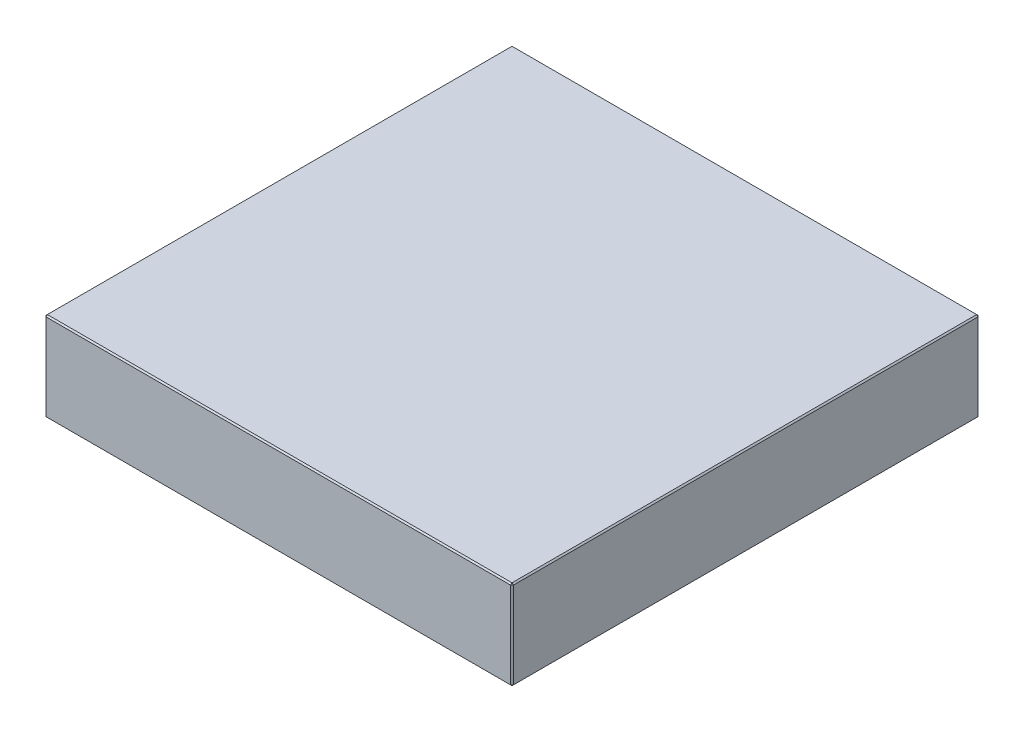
ISO-10303-21;
HEADER;
FILE_DESCRIPTION(('STEP AP214'),'2;1');
FILE_NAME('part.step','',(''),(''),'','','');
FILE_SCHEMA(('AUTOMOTIVE_DESIGN { 1 0 10303 214 1 1 1 1 }'));
ENDSEC;
DATA;
#1=APPLICATION_CONTEXT('core data for automotive mechanical design processes');
#2=APPLICATION_PROTOCOL_DEFINITION('international standard','automotive_design',2000,#1);
#3=PRODUCT_CONTEXT('',#1,'mechanical');
#4=PRODUCT('Part','Part','',(#3));
#5=PRODUCT_RELATED_PRODUCT_CATEGORY('part','',(#4));
#6=PRODUCT_DEFINITION_FORMATION('','',#4);
#7=PRODUCT_DEFINITION_CONTEXT('part definition',#1,'design');
#8=PRODUCT_DEFINITION('design','',#6,#7);
#9=PRODUCT_DEFINITION_SHAPE('','',#8);
#10=(LENGTH_UNIT() NAMED_UNIT(*) SI_UNIT(.MILLI.,.METRE.));
#11=(NAMED_UNIT(*) PLANE_ANGLE_UNIT() SI_UNIT($,.RADIAN.));
#12=(NAMED_UNIT(*) SI_UNIT($,.STERADIAN.) SOLID_ANGLE_UNIT());
#13=UNCERTAINTY_MEASURE_WITH_UNIT(LENGTH_MEASURE(1.E-05),#10,'distance_accuracy_value','');
#14=(GEOMETRIC_REPRESENTATION_CONTEXT(3) GLOBAL_UNCERTAINTY_ASSIGNED_CONTEXT((#13)) GLOBAL_UNIT_ASSIGNED_CONTEXT((#10,
#11,#12)) REPRESENTATION_CONTEXT('',''));
#15=CARTESIAN_POINT('',(0.,0.,0.));
#16=DIRECTION('',(0.,0.,1.));
#17=DIRECTION('',(1.,0.,0.));
#18=AXIS2_PLACEMENT_3D('',#15,#16,#17);
#19=CARTESIAN_POINT('',(-173.,66.,173.));
#20=DIRECTION('',(1.,0.,0.));
#21=DIRECTION('',(0.,0.,-1.));
#22=AXIS2_PLACEMENT_3D('',#19,#20,#21);
#23=PLANE('',#22);
#24=DIRECTION('',(0.,-1.,0.));
#25=VECTOR('',#24,1.);
#26=CARTESIAN_POINT('',(-173.,66.,-172.));
#27=LINE('',#26,#25);
#28=CARTESIAN_POINT('',(-173.,65.,-172.));
#29=VERTEX_POINT('',#28);
#30=CARTESIAN_POINT('',(-173.,1.00000000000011,-172.));
#31=VERTEX_POINT('',#30);
#32=EDGE_CURVE('E114',#29,#31,#27,.T.);
#33=ORIENTED_EDGE('',*,*,#32,.T.);
#34=DIRECTION('',(0.,0.,1.));
#35=VECTOR('',#34,1.);
#36=CARTESIAN_POINT('',(-173.,1.00000000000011,173.));
#37=LINE('',#36,#35);
#38=CARTESIAN_POINT('',(-173.,1.00000000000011,172.));
#39=VERTEX_POINT('',#38);
#40=EDGE_CURVE('E110',#31,#39,#37,.T.);
#41=ORIENTED_EDGE('',*,*,#40,.T.);
#42=DIRECTION('',(0.,1.,0.));
#43=VECTOR('',#42,1.);
#44=CARTESIAN_POINT('',(-173.,66.,172.));
#45=LINE('',#44,#43);
#46=CARTESIAN_POINT('',(-173.,65.,172.));
#47=VERTEX_POINT('',#46);
#48=EDGE_CURVE('E103',#39,#47,#45,.T.);
#49=ORIENTED_EDGE('',*,*,#48,.T.);
#50=DIRECTION('',(0.,0.,-1.));
#51=VECTOR('',#50,1.);
#52=CARTESIAN_POINT('',(-173.,65.,-173.));
#53=LINE('',#52,#51);
#54=EDGE_CURVE('E107',#47,#29,#53,.T.);
#55=ORIENTED_EDGE('',*,*,#54,.T.);
#56=EDGE_LOOP('',(#33,#41,#49,#55));
#57=FACE_BOUND('',#56,.T.);
#58=ADVANCED_FACE('F15',(#57),#23,.F.);
#59=CARTESIAN_POINT('',(173.,66.,173.));
#60=DIRECTION('',(0.,0.,-1.));
#61=DIRECTION('',(-1.,0.,0.));
#62=AXIS2_PLACEMENT_3D('',#59,#60,#61);
#63=PLANE('',#62);
#64=DIRECTION('',(-1.,0.,0.));
#65=VECTOR('',#64,1.);
#66=CARTESIAN_POINT('',(-173.,65.,173.));
#67=LINE('',#66,#65);
#68=CARTESIAN_POINT('',(172.,65.,173.));
#69=VERTEX_POINT('',#68);
#70=CARTESIAN_POINT('',(-172.,65.,173.));
#71=VERTEX_POINT('',#70);
#72=EDGE_CURVE('E164',#69,#71,#67,.T.);
#73=ORIENTED_EDGE('',*,*,#72,.T.);
#74=DIRECTION('',(0.,-1.,0.));
#75=VECTOR('',#74,1.);
#76=CARTESIAN_POINT('',(-172.,66.,173.));
#77=LINE('',#76,#75);
#78=CARTESIAN_POINT('',(-172.,1.00000000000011,173.));
#79=VERTEX_POINT('',#78);
#80=EDGE_CURVE('E122',#71,#79,#77,.T.);
#81=ORIENTED_EDGE('',*,*,#80,.T.);
#82=DIRECTION('',(1.,0.,0.));
#83=VECTOR('',#82,1.);
#84=CARTESIAN_POINT('',(173.,1.00000000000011,173.));
#85=LINE('',#84,#83);
#86=CARTESIAN_POINT('',(172.,1.00000000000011,173.));
#87=VERTEX_POINT('',#86);
#88=EDGE_CURVE('E168',#79,#87,#85,.T.);
#89=ORIENTED_EDGE('',*,*,#88,.T.);
#90=DIRECTION('',(0.,1.,0.));
#91=VECTOR('',#90,1.);
#92=CARTESIAN_POINT('',(172.,66.,173.));
#93=LINE('',#92,#91);
#94=EDGE_CURVE('E166',#87,#69,#93,.T.);
#95=ORIENTED_EDGE('',*,*,#94,.T.);
#96=EDGE_LOOP('',(#73,#81,#89,#95));
#97=FACE_BOUND('',#96,.T.);
#98=ADVANCED_FACE('F275',(#97),#63,.F.);
#99=CARTESIAN_POINT('',(173.,66.,173.));
#100=DIRECTION('',(-1.,0.,0.));
#101=DIRECTION('',(0.,0.,1.));
#102=AXIS2_PLACEMENT_3D('',#99,#100,#101);
#103=PLANE('',#102);
#104=DIRECTION('',(0.,0.,-1.));
#105=VECTOR('',#104,1.);
#106=CARTESIAN_POINT('',(173.,1.00000000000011,173.));
#107=LINE('',#106,#105);
#108=CARTESIAN_POINT('',(173.,1.00000000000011,172.));
#109=VERTEX_POINT('',#108);
#110=CARTESIAN_POINT('',(173.,1.00000000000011,-172.));
#111=VERTEX_POINT('',#110);
#112=EDGE_CURVE('E159',#109,#111,#107,.T.);
#113=ORIENTED_EDGE('',*,*,#112,.T.);
#114=DIRECTION('',(0.,1.,0.));
#115=VECTOR('',#114,1.);
#116=CARTESIAN_POINT('',(173.,66.,-172.));
#117=LINE('',#116,#115);
#118=CARTESIAN_POINT('',(173.,65.,-172.));
#119=VERTEX_POINT('',#118);
#120=EDGE_CURVE('E161',#111,#119,#117,.T.);
#121=ORIENTED_EDGE('',*,*,#120,.T.);
#122=DIRECTION('',(0.,0.,1.));
#123=VECTOR('',#122,1.);
#124=CARTESIAN_POINT('',(173.,65.,173.));
#125=LINE('',#124,#123);
#126=CARTESIAN_POINT('',(173.,65.,172.));
#127=VERTEX_POINT('',#126);
#128=EDGE_CURVE('E155',#119,#127,#125,.T.);
#129=ORIENTED_EDGE('',*,*,#128,.T.);
#130=DIRECTION('',(0.,-1.,0.));
#131=VECTOR('',#130,1.);
#132=CARTESIAN_POINT('',(173.,66.,172.));
#133=LINE('',#132,#131);
#134=EDGE_CURVE('E157',#127,#109,#133,.T.);
#135=ORIENTED_EDGE('',*,*,#134,.T.);
#136=EDGE_LOOP('',(#113,#121,#129,#135));
#137=FACE_BOUND('',#136,.T.);
#138=ADVANCED_FACE('F254',(#137),#103,.F.);
#139=CARTESIAN_POINT('',(173.,66.,-173.));
#140=DIRECTION('',(0.,0.,1.));
#141=DIRECTION('',(1.,0.,0.));
#142=AXIS2_PLACEMENT_3D('',#139,#140,#141);
#143=PLANE('',#142);
#144=DIRECTION('',(0.,-1.,0.));
#145=VECTOR('',#144,1.);
#146=CARTESIAN_POINT('',(172.,66.,-173.));
#147=LINE('',#146,#145);
#148=CARTESIAN_POINT('',(172.,65.,-173.));
#149=VERTEX_POINT('',#148);
#150=CARTESIAN_POINT('',(172.,1.00000000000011,-173.));
#151=VERTEX_POINT('',#150);
#152=EDGE_CURVE('E148',#149,#151,#147,.T.);
#153=ORIENTED_EDGE('',*,*,#152,.T.);
#154=DIRECTION('',(-1.,0.,0.));
#155=VECTOR('',#154,1.);
#156=CARTESIAN_POINT('',(173.,1.00000000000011,-173.));
#157=LINE('',#156,#155);
#158=CARTESIAN_POINT('',(-172.,1.00000000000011,-173.));
#159=VERTEX_POINT('',#158);
#160=EDGE_CURVE('E153',#151,#159,#157,.T.);
#161=ORIENTED_EDGE('',*,*,#160,.T.);
#162=DIRECTION('',(0.,1.,0.));
#163=VECTOR('',#162,1.);
#164=CARTESIAN_POINT('',(-172.,66.,-173.));
#165=LINE('',#164,#163);
#166=CARTESIAN_POINT('',(-172.,65.,-173.));
#167=VERTEX_POINT('',#166);
#168=EDGE_CURVE('E150',#159,#167,#165,.T.);
#169=ORIENTED_EDGE('',*,*,#168,.T.);
#170=DIRECTION('',(1.,0.,0.));
#171=VECTOR('',#170,1.);
#172=CARTESIAN_POINT('',(173.,65.,-173.));
#173=LINE('',#172,#171);
#174=EDGE_CURVE('E146',#167,#149,#173,.T.);
#175=ORIENTED_EDGE('',*,*,#174,.T.);
#176=EDGE_LOOP('',(#153,#161,#169,#175));
#177=FACE_BOUND('',#176,.T.);
#178=ADVANCED_FACE('F284',(#177),#143,.F.);
#179=CARTESIAN_POINT('',(0.,66.,0.));
#180=DIRECTION('',(0.,1.,0.));
#181=DIRECTION('',(0.,0.,1.));
#182=AXIS2_PLACEMENT_3D('',#179,#180,#181);
#183=PLANE('',#182);
#184=DIRECTION('',(0.,0.,-1.));
#185=VECTOR('',#184,1.);
#186=CARTESIAN_POINT('',(172.,66.,-173.));
#187=LINE('',#186,#185);
#188=CARTESIAN_POINT('',(172.,66.,172.));
#189=VERTEX_POINT('',#188);
#190=CARTESIAN_POINT('',(172.,66.,-172.));
#191=VERTEX_POINT('',#190);
#192=EDGE_CURVE('E24',#189,#191,#187,.T.);
#193=ORIENTED_EDGE('',*,*,#192,.T.);
#194=DIRECTION('',(-1.,0.,0.));
#195=VECTOR('',#194,1.);
#196=CARTESIAN_POINT('',(-173.,66.,-172.));
#197=LINE('',#196,#195);
#198=CARTESIAN_POINT('',(-172.,66.,-172.));
#199=VERTEX_POINT('',#198);
#200=EDGE_CURVE('E9',#191,#199,#197,.T.);
#201=ORIENTED_EDGE('',*,*,#200,.T.);
#202=DIRECTION('',(0.,0.,1.));
#203=VECTOR('',#202,1.);
#204=CARTESIAN_POINT('',(-172.,66.,173.));
#205=LINE('',#204,#203);
#206=CARTESIAN_POINT('',(-172.,66.,172.));
#207=VERTEX_POINT('',#206);
#208=EDGE_CURVE('E180',#199,#207,#205,.T.);
#209=ORIENTED_EDGE('',*,*,#208,.T.);
#210=DIRECTION('',(1.,0.,0.));
#211=VECTOR('',#210,1.);
#212=CARTESIAN_POINT('',(173.,66.,172.));
#213=LINE('',#212,#211);
#214=EDGE_CURVE('E35',#207,#189,#213,.T.);
#215=ORIENTED_EDGE('',*,*,#214,.T.);
#216=EDGE_LOOP('',(#193,#201,#209,#215));
#217=FACE_BOUND('',#216,.T.);
#218=ADVANCED_FACE('F350',(#217),#183,.T.);
#219=CARTESIAN_POINT('',(0.,0.,0.));
#220=DIRECTION('',(0.,1.,0.));
#221=DIRECTION('',(0.,0.,1.));
#222=AXIS2_PLACEMENT_3D('',#219,#220,#221);
#223=PLANE('',#222);
#224=DIRECTION('',(0.,0.,1.));
#225=VECTOR('',#224,1.);
#226=CARTESIAN_POINT('',(172.,0.,0.));
#227=LINE('',#226,#225);
#228=CARTESIAN_POINT('',(172.,0.,-172.));
#229=VERTEX_POINT('',#228);
#230=CARTESIAN_POINT('',(172.,0.,172.));
#231=VERTEX_POINT('',#230);
#232=EDGE_CURVE('E171',#229,#231,#227,.T.);
#233=ORIENTED_EDGE('',*,*,#232,.T.);
#234=DIRECTION('',(-1.,0.,0.));
#235=VECTOR('',#234,1.);
#236=CARTESIAN_POINT('',(0.,0.,172.));
#237=LINE('',#236,#235);
#238=CARTESIAN_POINT('',(-172.,0.,172.));
#239=VERTEX_POINT('',#238);
#240=EDGE_CURVE('E177',#231,#239,#237,.T.);
#241=ORIENTED_EDGE('',*,*,#240,.T.);
#242=DIRECTION('',(0.,0.,-1.));
#243=VECTOR('',#242,1.);
#244=CARTESIAN_POINT('',(-172.,0.,0.));
#245=LINE('',#244,#243);
#246=CARTESIAN_POINT('',(-172.,0.,-172.));
#247=VERTEX_POINT('',#246);
#248=EDGE_CURVE('E175',#239,#247,#245,.T.);
#249=ORIENTED_EDGE('',*,*,#248,.T.);
#250=DIRECTION('',(1.,0.,0.));
#251=VECTOR('',#250,1.);
#252=CARTESIAN_POINT('',(0.,0.,-172.));
#253=LINE('',#252,#251);
#254=EDGE_CURVE('E173',#247,#229,#253,.T.);
#255=ORIENTED_EDGE('',*,*,#254,.T.);
#256=EDGE_LOOP('',(#233,#241,#249,#255));
#257=FACE_BOUND('',#256,.T.);
#258=ADVANCED_FACE('F246',(#257),#223,.F.);
#259=CARTESIAN_POINT('',(173.,66.,172.));
#260=DIRECTION('',(-0.707106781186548,0.,-0.707106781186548));
#261=DIRECTION('',(0.,-1.,0.));
#262=AXIS2_PLACEMENT_3D('',#259,#260,#261);
#263=PLANE('',#262);
#264=DIRECTION('',(-0.707106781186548,0.,0.707106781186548));
#265=VECTOR('',#264,1.);
#266=CARTESIAN_POINT('',(172.,65.,173.));
#267=LINE('',#266,#265);
#268=EDGE_CURVE('E19',#69,#127,#267,.F.);
#269=ORIENTED_EDGE('',*,*,#268,.F.);
#270=ORIENTED_EDGE('',*,*,#94,.F.);
#271=DIRECTION('',(0.707106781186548,0.,-0.707106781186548));
#272=VECTOR('',#271,1.);
#273=CARTESIAN_POINT('',(172.,1.00000000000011,173.));
#274=LINE('',#273,#272);
#275=EDGE_CURVE('E142',#109,#87,#274,.F.);
#276=ORIENTED_EDGE('',*,*,#275,.F.);
#277=ORIENTED_EDGE('',*,*,#134,.F.);
#278=EDGE_LOOP('',(#269,#270,#276,#277));
#279=FACE_BOUND('',#278,.T.);
#280=ADVANCED_FACE('F17',(#279),#263,.F.);
#281=CARTESIAN_POINT('',(172.,65.,173.));
#282=DIRECTION('',(0.577350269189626,0.577350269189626,0.577350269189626));
#283=DIRECTION('',(0.707106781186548,0.,-0.707106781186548));
#284=AXIS2_PLACEMENT_3D('',#281,#282,#283);
#285=PLANE('',#284);
#286=DIRECTION('',(0.,-0.707106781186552,0.707106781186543));
#287=VECTOR('',#286,1.);
#288=CARTESIAN_POINT('',(172.,65.,173.));
#289=LINE('',#288,#287);
#290=EDGE_CURVE('E226',#69,#189,#289,.F.);
#291=ORIENTED_EDGE('',*,*,#290,.F.);
#292=ORIENTED_EDGE('',*,*,#268,.T.);
#293=DIRECTION('',(-0.707106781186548,0.707106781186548,0.));
#294=VECTOR('',#293,1.);
#295=CARTESIAN_POINT('',(172.5,65.5,172.));
#296=LINE('',#295,#294);
#297=EDGE_CURVE('E228',#189,#127,#296,.F.);
#298=ORIENTED_EDGE('',*,*,#297,.F.);
#299=EDGE_LOOP('',(#291,#292,#298));
#300=FACE_BOUND('',#299,.T.);
#301=ADVANCED_FACE('F270',(#300),#285,.T.);
#302=CARTESIAN_POINT('',(172.,1.00000000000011,173.));
#303=DIRECTION('',(0.577350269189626,-0.577350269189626,0.577350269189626));
#304=DIRECTION('',(0.707106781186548,0.,-0.707106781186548));
#305=AXIS2_PLACEMENT_3D('',#302,#303,#304);
#306=PLANE('',#305);
#307=DIRECTION('',(-0.707106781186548,-0.707106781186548,0.));
#308=VECTOR('',#307,1.);
#309=CARTESIAN_POINT('',(172.5,0.500000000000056,172.));
#310=LINE('',#309,#308);
#311=EDGE_CURVE('E220',#109,#231,#310,.T.);
#312=ORIENTED_EDGE('',*,*,#311,.F.);
#313=ORIENTED_EDGE('',*,*,#275,.T.);
#314=DIRECTION('',(0.,0.707106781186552,0.707106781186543));
#315=VECTOR('',#314,1.);
#316=CARTESIAN_POINT('',(172.,1.00000000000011,173.));
#317=LINE('',#316,#315);
#318=EDGE_CURVE('E223',#231,#87,#317,.T.);
#319=ORIENTED_EDGE('',*,*,#318,.F.);
#320=EDGE_LOOP('',(#312,#313,#319));
#321=FACE_BOUND('',#320,.T.);
#322=ADVANCED_FACE('F235',(#321),#306,.T.);
#323=CARTESIAN_POINT('',(172.,66.,0.));
#324=DIRECTION('',(0.707106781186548,0.707106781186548,0.));
#325=DIRECTION('',(0.,0.,1.));
#326=AXIS2_PLACEMENT_3D('',#323,#324,#325);
#327=PLANE('',#326);
#328=ORIENTED_EDGE('',*,*,#297,.T.);
#329=ORIENTED_EDGE('',*,*,#128,.F.);
#330=DIRECTION('',(0.707106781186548,-0.707106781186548,0.));
#331=VECTOR('',#330,1.);
#332=CARTESIAN_POINT('',(173.,65.,-172.));
#333=LINE('',#332,#331);
#334=EDGE_CURVE('E215',#191,#119,#333,.T.);
#335=ORIENTED_EDGE('',*,*,#334,.F.);
#336=ORIENTED_EDGE('',*,*,#192,.F.);
#337=EDGE_LOOP('',(#328,#329,#335,#336));
#338=FACE_BOUND('',#337,.T.);
#339=ADVANCED_FACE('F265',(#338),#327,.T.);
#340=CARTESIAN_POINT('',(0.,66.,172.));
#341=DIRECTION('',(0.,0.707106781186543,0.707106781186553));
#342=DIRECTION('',(-1.,0.,0.));
#343=AXIS2_PLACEMENT_3D('',#340,#341,#342);
#344=PLANE('',#343);
#345=ORIENTED_EDGE('',*,*,#290,.T.);
#346=ORIENTED_EDGE('',*,*,#214,.F.);
#347=DIRECTION('',(0.,0.707106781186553,-0.707106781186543));
#348=VECTOR('',#347,1.);
#349=CARTESIAN_POINT('',(-172.,65.5,172.5));
#350=LINE('',#349,#348);
#351=EDGE_CURVE('E126',#71,#207,#350,.T.);
#352=ORIENTED_EDGE('',*,*,#351,.F.);
#353=ORIENTED_EDGE('',*,*,#72,.F.);
#354=EDGE_LOOP('',(#345,#346,#352,#353));
#355=FACE_BOUND('',#354,.T.);
#356=ADVANCED_FACE('F273',(#355),#344,.T.);
#357=CARTESIAN_POINT('',(-172.,66.,173.));
#358=DIRECTION('',(0.707106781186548,0.,-0.707106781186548));
#359=DIRECTION('',(0.,-1.,0.));
#360=AXIS2_PLACEMENT_3D('',#357,#358,#359);
#361=PLANE('',#360);
#362=DIRECTION('',(0.707106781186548,0.,0.707106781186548));
#363=VECTOR('',#362,1.);
#364=CARTESIAN_POINT('',(-172.,1.00000000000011,173.));
#365=LINE('',#364,#363);
#366=EDGE_CURVE('E127',#79,#39,#365,.F.);
#367=ORIENTED_EDGE('',*,*,#366,.F.);
#368=ORIENTED_EDGE('',*,*,#80,.F.);
#369=DIRECTION('',(-0.707106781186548,0.,-0.707106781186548));
#370=VECTOR('',#369,1.);
#371=CARTESIAN_POINT('',(-173.,65.,172.));
#372=LINE('',#371,#370);
#373=EDGE_CURVE('E118',#47,#71,#372,.F.);
#374=ORIENTED_EDGE('',*,*,#373,.F.);
#375=ORIENTED_EDGE('',*,*,#48,.F.);
#376=EDGE_LOOP('',(#367,#368,#374,#375));
#377=FACE_BOUND('',#376,.T.);
#378=ADVANCED_FACE('F120',(#377),#361,.F.);
#379=CARTESIAN_POINT('',(173.,1.00000000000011,173.));
#380=DIRECTION('',(0.,0.707106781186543,-0.707106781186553));
#381=DIRECTION('',(1.,0.,0.));
#382=AXIS2_PLACEMENT_3D('',#379,#380,#381);
#383=PLANE('',#382);
#384=ORIENTED_EDGE('',*,*,#318,.T.);
#385=ORIENTED_EDGE('',*,*,#88,.F.);
#386=DIRECTION('',(0.,-0.707106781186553,-0.707106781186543));
#387=VECTOR('',#386,1.);
#388=CARTESIAN_POINT('',(-172.,1.00000000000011,173.));
#389=LINE('',#388,#387);
#390=EDGE_CURVE('E211',#239,#79,#389,.F.);
#391=ORIENTED_EDGE('',*,*,#390,.F.);
#392=ORIENTED_EDGE('',*,*,#240,.F.);
#393=EDGE_LOOP('',(#384,#385,#391,#392));
#394=FACE_BOUND('',#393,.T.);
#395=ADVANCED_FACE('F243',(#394),#383,.F.);
#396=CARTESIAN_POINT('',(173.,1.00000000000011,173.));
#397=DIRECTION('',(-0.707106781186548,0.707106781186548,0.));
#398=DIRECTION('',(0.,0.,-1.));
#399=AXIS2_PLACEMENT_3D('',#396,#397,#398);
#400=PLANE('',#399);
#401=ORIENTED_EDGE('',*,*,#311,.T.);
#402=ORIENTED_EDGE('',*,*,#232,.F.);
#403=DIRECTION('',(0.707106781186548,0.707106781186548,0.));
#404=VECTOR('',#403,1.);
#405=CARTESIAN_POINT('',(172.5,0.500000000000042,-172.));
#406=LINE('',#405,#404);
#407=EDGE_CURVE('E208',#111,#229,#406,.F.);
#408=ORIENTED_EDGE('',*,*,#407,.F.);
#409=ORIENTED_EDGE('',*,*,#112,.F.);
#410=EDGE_LOOP('',(#401,#402,#408,#409));
#411=FACE_BOUND('',#410,.T.);
#412=ADVANCED_FACE('F251',(#411),#400,.F.);
#413=CARTESIAN_POINT('',(172.,66.,-173.));
#414=DIRECTION('',(-0.707106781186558,0.,0.707106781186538));
#415=DIRECTION('',(0.,-1.,0.));
#416=AXIS2_PLACEMENT_3D('',#413,#414,#415);
#417=PLANE('',#416);
#418=DIRECTION('',(0.707106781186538,0.,0.707106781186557));
#419=VECTOR('',#418,1.);
#420=CARTESIAN_POINT('',(173.,65.,-172.));
#421=LINE('',#420,#419);
#422=EDGE_CURVE('E217',#119,#149,#421,.F.);
#423=ORIENTED_EDGE('',*,*,#422,.F.);
#424=ORIENTED_EDGE('',*,*,#120,.F.);
#425=DIRECTION('',(-0.707106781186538,0.,-0.707106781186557));
#426=VECTOR('',#425,1.);
#427=CARTESIAN_POINT('',(172.,1.00000000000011,-173.));
#428=LINE('',#427,#426);
#429=EDGE_CURVE('E205',#151,#111,#428,.F.);
#430=ORIENTED_EDGE('',*,*,#429,.F.);
#431=ORIENTED_EDGE('',*,*,#152,.F.);
#432=EDGE_LOOP('',(#423,#424,#430,#431));
#433=FACE_BOUND('',#432,.T.);
#434=ADVANCED_FACE('F258',(#433),#417,.F.);
#435=CARTESIAN_POINT('',(173.,65.,-172.));
#436=DIRECTION('',(0.577350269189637,0.577350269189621,-0.577350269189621));
#437=DIRECTION('',(-0.707106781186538,0.,-0.707106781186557));
#438=AXIS2_PLACEMENT_3D('',#435,#436,#437);
#439=PLANE('',#438);
#440=ORIENTED_EDGE('',*,*,#334,.T.);
#441=ORIENTED_EDGE('',*,*,#422,.T.);
#442=DIRECTION('',(0.,0.707106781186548,0.707106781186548));
#443=VECTOR('',#442,1.);
#444=CARTESIAN_POINT('',(172.,65.5,-172.5));
#445=LINE('',#444,#443);
#446=EDGE_CURVE('E134',#191,#149,#445,.F.);
#447=ORIENTED_EDGE('',*,*,#446,.F.);
#448=EDGE_LOOP('',(#440,#441,#447));
#449=FACE_BOUND('',#448,.T.);
#450=ADVANCED_FACE('F325',(#449),#439,.T.);
#451=CARTESIAN_POINT('',(-173.,65.,172.));
#452=DIRECTION('',(-0.577350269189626,0.577350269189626,0.577350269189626));
#453=DIRECTION('',(0.707106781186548,0.,0.707106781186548));
#454=AXIS2_PLACEMENT_3D('',#451,#452,#453);
#455=PLANE('',#454);
#456=ORIENTED_EDGE('',*,*,#373,.T.);
#457=ORIENTED_EDGE('',*,*,#351,.T.);
#458=DIRECTION('',(-0.707106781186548,-0.707106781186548,0.));
#459=VECTOR('',#458,1.);
#460=CARTESIAN_POINT('',(-173.,65.,172.));
#461=LINE('',#460,#459);
#462=EDGE_CURVE('E130',#47,#207,#461,.F.);
#463=ORIENTED_EDGE('',*,*,#462,.F.);
#464=EDGE_LOOP('',(#456,#457,#463));
#465=FACE_BOUND('',#464,.T.);
#466=ADVANCED_FACE('F131',(#465),#455,.T.);
#467=CARTESIAN_POINT('',(-172.,1.00000000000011,173.));
#468=DIRECTION('',(-0.577350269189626,-0.577350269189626,0.577350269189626));
#469=DIRECTION('',(0.707106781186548,0.,0.707106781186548));
#470=AXIS2_PLACEMENT_3D('',#467,#468,#469);
#471=PLANE('',#470);
#472=ORIENTED_EDGE('',*,*,#390,.T.);
#473=ORIENTED_EDGE('',*,*,#366,.T.);
#474=DIRECTION('',(-0.707106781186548,0.707106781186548,0.));
#475=VECTOR('',#474,1.);
#476=CARTESIAN_POINT('',(-172.5,0.500000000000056,172.));
#477=LINE('',#476,#475);
#478=EDGE_CURVE('E135',#239,#39,#477,.T.);
#479=ORIENTED_EDGE('',*,*,#478,.F.);
#480=EDGE_LOOP('',(#472,#473,#479));
#481=FACE_BOUND('',#480,.T.);
#482=ADVANCED_FACE('F318',(#481),#471,.T.);
#483=CARTESIAN_POINT('',(172.,1.00000000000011,-173.));
#484=DIRECTION('',(0.577350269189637,-0.577350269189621,-0.577350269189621));
#485=DIRECTION('',(-0.707106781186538,0.,-0.707106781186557));
#486=AXIS2_PLACEMENT_3D('',#483,#484,#485);
#487=PLANE('',#486);
#488=ORIENTED_EDGE('',*,*,#429,.T.);
#489=ORIENTED_EDGE('',*,*,#407,.T.);
#490=DIRECTION('',(0.,-0.707106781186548,0.707106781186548));
#491=VECTOR('',#490,1.);
#492=CARTESIAN_POINT('',(172.,1.00000000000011,-173.));
#493=LINE('',#492,#491);
#494=EDGE_CURVE('E198',#151,#229,#493,.T.);
#495=ORIENTED_EDGE('',*,*,#494,.F.);
#496=EDGE_LOOP('',(#488,#489,#495));
#497=FACE_BOUND('',#496,.T.);
#498=ADVANCED_FACE('F314',(#497),#487,.T.);
#499=CARTESIAN_POINT('',(0.,66.,-172.));
#500=DIRECTION('',(0.,0.707106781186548,-0.707106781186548));
#501=DIRECTION('',(1.,0.,0.));
#502=AXIS2_PLACEMENT_3D('',#499,#500,#501);
#503=PLANE('',#502);
#504=ORIENTED_EDGE('',*,*,#446,.T.);
#505=ORIENTED_EDGE('',*,*,#174,.F.);
#506=DIRECTION('',(0.,-0.707106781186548,-0.707106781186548));
#507=VECTOR('',#506,1.);
#508=CARTESIAN_POINT('',(-172.,65.,-173.));
#509=LINE('',#508,#507);
#510=EDGE_CURVE('E195',#199,#167,#509,.T.);
#511=ORIENTED_EDGE('',*,*,#510,.F.);
#512=ORIENTED_EDGE('',*,*,#200,.F.);
#513=EDGE_LOOP('',(#504,#505,#511,#512));
#514=FACE_BOUND('',#513,.T.);
#515=ADVANCED_FACE('F311',(#514),#503,.T.);
#516=CARTESIAN_POINT('',(-172.,66.,0.));
#517=DIRECTION('',(-0.707106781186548,0.707106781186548,0.));
#518=DIRECTION('',(0.,0.,-1.));
#519=AXIS2_PLACEMENT_3D('',#516,#517,#518);
#520=PLANE('',#519);
#521=ORIENTED_EDGE('',*,*,#462,.T.);
#522=ORIENTED_EDGE('',*,*,#208,.F.);
#523=DIRECTION('',(0.707106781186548,0.707106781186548,0.));
#524=VECTOR('',#523,1.);
#525=CARTESIAN_POINT('',(-172.5,65.5,-172.));
#526=LINE('',#525,#524);
#527=EDGE_CURVE('E138',#29,#199,#526,.T.);
#528=ORIENTED_EDGE('',*,*,#527,.F.);
#529=ORIENTED_EDGE('',*,*,#54,.F.);
#530=EDGE_LOOP('',(#521,#522,#528,#529));
#531=FACE_BOUND('',#530,.T.);
#532=ADVANCED_FACE('F137',(#531),#520,.T.);
#533=CARTESIAN_POINT('',(-173.,1.00000000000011,173.));
#534=DIRECTION('',(0.707106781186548,0.707106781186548,0.));
#535=DIRECTION('',(0.,0.,1.));
#536=AXIS2_PLACEMENT_3D('',#533,#534,#535);
#537=PLANE('',#536);
#538=ORIENTED_EDGE('',*,*,#478,.T.);
#539=ORIENTED_EDGE('',*,*,#40,.F.);
#540=DIRECTION('',(0.707106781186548,-0.707106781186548,0.));
#541=VECTOR('',#540,1.);
#542=CARTESIAN_POINT('',(-173.,1.00000000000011,-172.));
#543=LINE('',#542,#541);
#544=EDGE_CURVE('E191',#247,#31,#543,.F.);
#545=ORIENTED_EDGE('',*,*,#544,.F.);
#546=ORIENTED_EDGE('',*,*,#248,.F.);
#547=EDGE_LOOP('',(#538,#539,#545,#546));
#548=FACE_BOUND('',#547,.T.);
#549=ADVANCED_FACE('F304',(#548),#537,.F.);
#550=CARTESIAN_POINT('',(173.,1.00000000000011,-173.));
#551=DIRECTION('',(0.,0.707106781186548,0.707106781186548));
#552=DIRECTION('',(-1.,0.,0.));
#553=AXIS2_PLACEMENT_3D('',#550,#551,#552);
#554=PLANE('',#553);
#555=ORIENTED_EDGE('',*,*,#494,.T.);
#556=ORIENTED_EDGE('',*,*,#254,.F.);
#557=DIRECTION('',(0.,0.707106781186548,-0.707106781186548));
#558=VECTOR('',#557,1.);
#559=CARTESIAN_POINT('',(-172.,0.500000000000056,-172.5));
#560=LINE('',#559,#558);
#561=EDGE_CURVE('E188',#159,#247,#560,.F.);
#562=ORIENTED_EDGE('',*,*,#561,.F.);
#563=ORIENTED_EDGE('',*,*,#160,.F.);
#564=EDGE_LOOP('',(#555,#556,#562,#563));
#565=FACE_BOUND('',#564,.T.);
#566=ADVANCED_FACE('F300',(#565),#554,.F.);
#567=CARTESIAN_POINT('',(-172.,65.,-173.));
#568=DIRECTION('',(-0.577350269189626,0.577350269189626,-0.577350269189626));
#569=DIRECTION('',(-0.707106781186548,0.,0.707106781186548));
#570=AXIS2_PLACEMENT_3D('',#567,#568,#569);
#571=PLANE('',#570);
#572=ORIENTED_EDGE('',*,*,#527,.T.);
#573=ORIENTED_EDGE('',*,*,#510,.T.);
#574=DIRECTION('',(0.707106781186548,0.,-0.707106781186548));
#575=VECTOR('',#574,1.);
#576=CARTESIAN_POINT('',(-172.,65.,-173.));
#577=LINE('',#576,#575);
#578=EDGE_CURVE('E186',#29,#167,#577,.T.);
#579=ORIENTED_EDGE('',*,*,#578,.F.);
#580=EDGE_LOOP('',(#572,#573,#579));
#581=FACE_BOUND('',#580,.T.);
#582=ADVANCED_FACE('F296',(#581),#571,.T.);
#583=CARTESIAN_POINT('',(-173.,1.00000000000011,-172.));
#584=DIRECTION('',(-0.577350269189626,-0.577350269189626,-0.577350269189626));
#585=DIRECTION('',(-0.707106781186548,0.,0.707106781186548));
#586=AXIS2_PLACEMENT_3D('',#583,#584,#585);
#587=PLANE('',#586);
#588=ORIENTED_EDGE('',*,*,#561,.T.);
#589=ORIENTED_EDGE('',*,*,#544,.T.);
#590=DIRECTION('',(-0.707106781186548,0.,0.707106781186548));
#591=VECTOR('',#590,1.);
#592=CARTESIAN_POINT('',(-173.,1.00000000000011,-172.));
#593=LINE('',#592,#591);
#594=EDGE_CURVE('E184',#159,#31,#593,.T.);
#595=ORIENTED_EDGE('',*,*,#594,.F.);
#596=EDGE_LOOP('',(#588,#589,#595));
#597=FACE_BOUND('',#596,.T.);
#598=ADVANCED_FACE('F292',(#597),#587,.T.);
#599=CARTESIAN_POINT('',(-173.,66.,-172.));
#600=DIRECTION('',(0.707106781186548,0.,0.707106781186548));
#601=DIRECTION('',(0.,-1.,0.));
#602=AXIS2_PLACEMENT_3D('',#599,#600,#601);
#603=PLANE('',#602);
#604=ORIENTED_EDGE('',*,*,#578,.T.);
#605=ORIENTED_EDGE('',*,*,#168,.F.);
#606=ORIENTED_EDGE('',*,*,#594,.T.);
#607=ORIENTED_EDGE('',*,*,#32,.F.);
#608=EDGE_LOOP('',(#604,#605,#606,#607));
#609=FACE_BOUND('',#608,.T.);
#610=ADVANCED_FACE('F289',(#609),#603,.F.);
#611=CLOSED_SHELL('',(#58,#98,#138,#178,#218,#258,#280,#301,#322,#339,#356,#378,#395,#412,#434,
#450,#466,#482,#498,#515,#532,#549,#566,#582,#598,#610));
#612=MANIFOLD_SOLID_BREP('B1',#611);
#613=ADVANCED_BREP_SHAPE_REPRESENTATION('',(#18,#612),#14);
#614=SHAPE_DEFINITION_REPRESENTATION(#9,#613);
ENDSEC;
END-ISO-10303-21;
